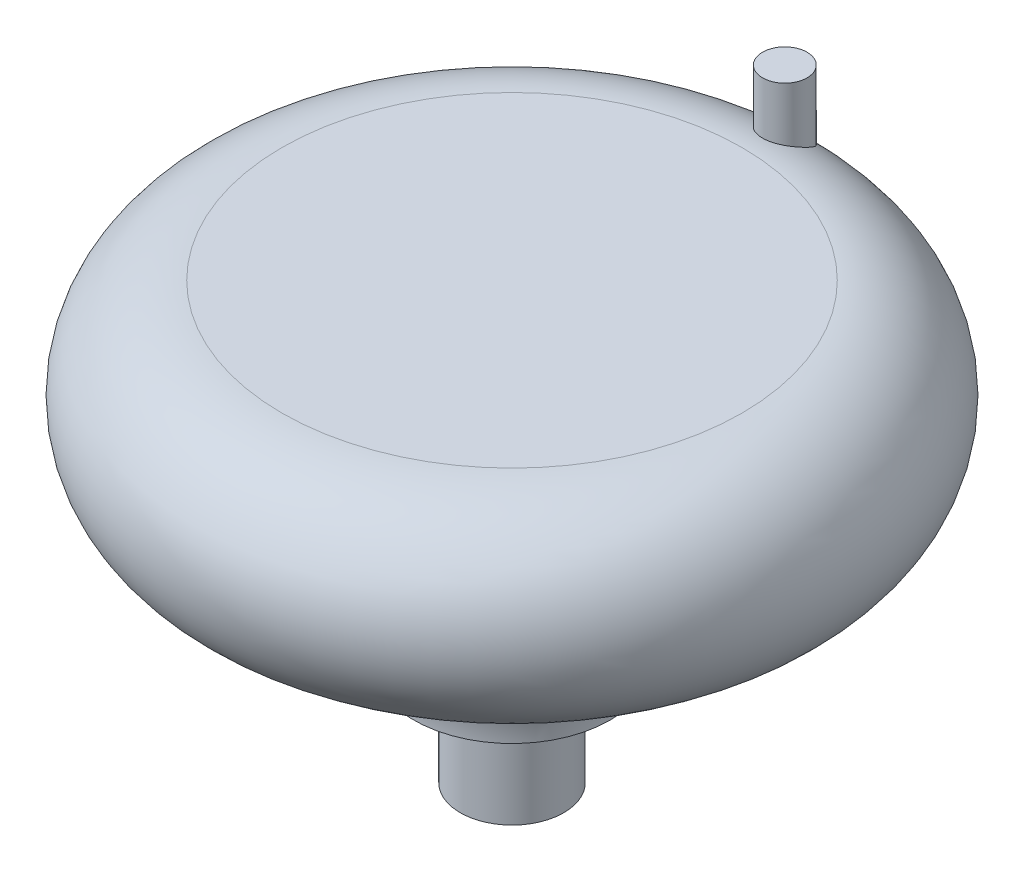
ISO-10303-21;
HEADER;
FILE_DESCRIPTION(('STEP AP214'),'2;1');
FILE_NAME('part.step','',(''),(''),'','','');
FILE_SCHEMA(('AUTOMOTIVE_DESIGN { 1 0 10303 214 1 1 1 1 }'));
ENDSEC;
DATA;
#1=APPLICATION_CONTEXT('core data for automotive mechanical design processes');
#2=APPLICATION_PROTOCOL_DEFINITION('international standard','automotive_design',2000,#1);
#3=PRODUCT_CONTEXT('',#1,'mechanical');
#4=PRODUCT('Part','Part','',(#3));
#5=PRODUCT_RELATED_PRODUCT_CATEGORY('part','',(#4));
#6=PRODUCT_DEFINITION_FORMATION('','',#4);
#7=PRODUCT_DEFINITION_CONTEXT('part definition',#1,'design');
#8=PRODUCT_DEFINITION('design','',#6,#7);
#9=PRODUCT_DEFINITION_SHAPE('','',#8);
#10=(LENGTH_UNIT() NAMED_UNIT(*) SI_UNIT(.MILLI.,.METRE.));
#11=(NAMED_UNIT(*) PLANE_ANGLE_UNIT() SI_UNIT($,.RADIAN.));
#12=(NAMED_UNIT(*) SI_UNIT($,.STERADIAN.) SOLID_ANGLE_UNIT());
#13=UNCERTAINTY_MEASURE_WITH_UNIT(LENGTH_MEASURE(1.E-05),#10,'distance_accuracy_value','');
#14=(GEOMETRIC_REPRESENTATION_CONTEXT(3) GLOBAL_UNCERTAINTY_ASSIGNED_CONTEXT((#13)) GLOBAL_UNIT_ASSIGNED_CONTEXT((#10,
#11,#12)) REPRESENTATION_CONTEXT('',''));
#15=CARTESIAN_POINT('',(0.,0.,0.));
#16=DIRECTION('',(0.,0.,1.));
#17=DIRECTION('',(1.,0.,0.));
#18=AXIS2_PLACEMENT_3D('',#15,#16,#17);
#19=CARTESIAN_POINT('',(0.,6.35,0.));
#20=DIRECTION('',(0.,-1.,0.));
#21=DIRECTION('',(1.,0.,0.));
#22=AXIS2_PLACEMENT_3D('',#19,#20,#21);
#23=PLANE('',#22);
#24=CARTESIAN_POINT('',(0.,6.35,0.));
#25=DIRECTION('',(0.,-1.,0.));
#26=DIRECTION('',(1.,0.,0.));
#27=AXIS2_PLACEMENT_3D('',#24,#25,#26);
#28=CIRCLE('',#27,4.75);
#29=CARTESIAN_POINT('',(4.75,6.35,0.));
#30=VERTEX_POINT('',#29);
#31=EDGE_CURVE('E45',#30,#30,#28,.T.);
#32=ORIENTED_EDGE('',*,*,#31,.T.);
#33=EDGE_LOOP('',(#32));
#34=FACE_BOUND('',#33,.T.);
#35=CARTESIAN_POINT('',(0.,6.35,0.));
#36=DIRECTION('',(0.,-1.,0.));
#37=DIRECTION('',(0.,0.,-1.));
#38=AXIS2_PLACEMENT_3D('',#35,#36,#37);
#39=CIRCLE('',#38,2.5);
#40=CARTESIAN_POINT('',(0.,6.35,-2.5));
#41=VERTEX_POINT('',#40);
#42=EDGE_CURVE('E55',#41,#41,#39,.T.);
#43=ORIENTED_EDGE('',*,*,#42,.F.);
#44=EDGE_LOOP('',(#43));
#45=FACE_BOUND('',#44,.T.);
#46=ADVANCED_FACE('F30',(#34,#45),#23,.T.);
#47=CARTESIAN_POINT('',(0.,17.55,0.));
#48=DIRECTION('',(0.,-1.,0.));
#49=DIRECTION('',(1.,0.,0.));
#50=AXIS2_PLACEMENT_3D('',#47,#48,#49);
#51=TOROIDAL_SURFACE('',#50,11.099803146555,4.8);
#52=CARTESIAN_POINT('',(-0.748566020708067,21.4094575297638,-13.9335820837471));
#53=CARTESIAN_POINT('',(-0.797854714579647,21.442897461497,-13.8856436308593));
#54=CARTESIAN_POINT('',(-0.841941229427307,21.4781547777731,-13.8335582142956));
#55=CARTESIAN_POINT('',(-0.919235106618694,21.5502775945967,-13.7227691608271));
#56=CARTESIAN_POINT('',(-0.952423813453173,21.5871457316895,-13.6640544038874));
#57=CARTESIAN_POINT('',(-1.00727626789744,21.6608050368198,-13.5415662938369));
#58=CARTESIAN_POINT('',(-1.02895953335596,21.6975962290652,-13.4778017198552));
#59=CARTESIAN_POINT('',(-1.06013724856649,21.769788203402,-13.346624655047));
#60=CARTESIAN_POINT('',(-1.06963728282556,21.8051896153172,-13.2792138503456));
#61=CARTESIAN_POINT('',(-1.07564050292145,21.8736722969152,-13.1419370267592));
#62=CARTESIAN_POINT('',(-1.07203999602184,21.9067329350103,-13.0720557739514));
#63=CARTESIAN_POINT('',(-1.05082320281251,21.9690822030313,-12.9327124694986));
#64=CARTESIAN_POINT('',(-1.03321534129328,21.9983730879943,-12.8632501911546));
#65=CARTESIAN_POINT('',(-0.986089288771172,22.0496734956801,-12.7342604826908));
#66=CARTESIAN_POINT('',(-0.957891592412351,22.0721136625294,-12.6744228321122));
#67=CARTESIAN_POINT('',(-0.890155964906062,22.1127840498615,-12.5599621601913));
#68=CARTESIAN_POINT('',(-0.850626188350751,22.1310172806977,-12.5053354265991));
#69=CARTESIAN_POINT('',(-0.765740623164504,22.1615775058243,-12.4088827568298));
#70=CARTESIAN_POINT('',(-0.721362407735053,22.1743127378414,-12.3663230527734));
#71=CARTESIAN_POINT('',(-0.625472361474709,22.1964498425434,-12.2891055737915));
#72=CARTESIAN_POINT('',(-0.573962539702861,22.2058526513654,-12.2544455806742));
#73=CARTESIAN_POINT('',(-0.46800637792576,22.2212093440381,-12.1958339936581));
#74=CARTESIAN_POINT('',(-0.413821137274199,22.2273075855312,-12.1714468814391));
#75=CARTESIAN_POINT('',(-0.301969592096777,22.2369766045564,-12.1319012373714));
#76=CARTESIAN_POINT('',(-0.244303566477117,22.2405475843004,-12.116741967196));
#77=CARTESIAN_POINT('',(-0.127803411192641,22.245326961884,-12.096278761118));
#78=CARTESIAN_POINT('',(-0.0689887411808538,22.2465605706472,-12.090869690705));
#79=CARTESIAN_POINT('',(0.0487372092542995,22.2468155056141,-12.0897596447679));
#80=CARTESIAN_POINT('',(0.107648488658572,22.2458368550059,-12.0940585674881));
#81=CARTESIAN_POINT('',(0.223864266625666,22.2416096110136,-12.1122199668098));
#82=CARTESIAN_POINT('',(0.281169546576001,22.2383621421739,-12.1260777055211));
#83=CARTESIAN_POINT('',(0.392574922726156,22.2294248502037,-12.1628919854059));
#84=CARTESIAN_POINT('',(0.446675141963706,22.2237351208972,-12.1858481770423));
#85=CARTESIAN_POINT('',(0.550157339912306,22.2096738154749,-12.2400852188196));
#86=CARTESIAN_POINT('',(0.599538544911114,22.2013018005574,-12.2713674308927));
#87=CARTESIAN_POINT('',(0.69222510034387,22.1816476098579,-12.3411678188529));
#88=CARTESIAN_POINT('',(0.735530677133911,22.1703655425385,-12.3796857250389));
#89=CARTESIAN_POINT('',(0.81528700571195,22.1446512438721,-12.4629309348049));
#90=CARTESIAN_POINT('',(0.851683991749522,22.130196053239,-12.5077025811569));
#91=CARTESIAN_POINT('',(0.916461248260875,22.0981862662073,-12.6017015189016));
#92=CARTESIAN_POINT('',(0.944840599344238,22.0806313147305,-12.6509293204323));
#93=CARTESIAN_POINT('',(0.994046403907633,22.0419187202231,-12.7540646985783));
#94=CARTESIAN_POINT('',(1.01457169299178,22.0206559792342,-12.8080760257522));
#95=CARTESIAN_POINT('',(1.04656816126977,21.9753445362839,-12.9175795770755));
#96=CARTESIAN_POINT('',(1.05803642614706,21.9512949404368,-12.9730722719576));
#97=CARTESIAN_POINT('',(1.07269919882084,21.8989151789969,-13.0884813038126));
#98=CARTESIAN_POINT('',(1.07517400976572,21.8703972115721,-13.1484031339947));
#99=CARTESIAN_POINT('',(1.07035173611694,21.8113995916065,-13.2668595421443));
#100=CARTESIAN_POINT('',(1.06305099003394,21.7809192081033,-13.3253935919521));
#101=CARTESIAN_POINT('',(1.03797780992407,21.7155326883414,-13.4458860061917));
#102=CARTESIAN_POINT('',(1.01919148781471,21.6804967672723,-13.5075636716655));
#103=CARTESIAN_POINT('',(0.971009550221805,21.6101265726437,-13.6265164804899));
#104=CARTESIAN_POINT('',(0.941603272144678,21.5747920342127,-13.6837871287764));
#105=CARTESIAN_POINT('',(0.870318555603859,21.5027913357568,-13.7963907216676));
#106=CARTESIAN_POINT('',(0.827722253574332,21.4662003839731,-13.8513204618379));
#107=CARTESIAN_POINT('',(0.731468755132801,21.3962844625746,-13.9529499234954));
#108=CARTESIAN_POINT('',(0.677827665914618,21.3629548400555,-13.9996614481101));
#109=CARTESIAN_POINT('',(0.57631846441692,21.3105487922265,-14.0712881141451));
#110=CARTESIAN_POINT('',(0.530907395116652,21.290071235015,-14.098666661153));
#111=CARTESIAN_POINT('',(0.435118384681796,21.2534671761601,-14.1469109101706));
#112=CARTESIAN_POINT('',(0.384744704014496,21.2373369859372,-14.1677821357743));
#113=CARTESIAN_POINT('',(0.279545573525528,21.2106262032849,-14.2020279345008));
#114=CARTESIAN_POINT('',(0.22468497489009,21.2000954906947,-14.2153351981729));
#115=CARTESIAN_POINT('',(0.112691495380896,21.1859605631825,-14.2331415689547));
#116=CARTESIAN_POINT('',(0.0555610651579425,21.1823490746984,-14.2376499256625));
#117=CARTESIAN_POINT('',(-0.0506153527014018,21.1824634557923,-14.2375048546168));
#118=CARTESIAN_POINT('',(-0.0996700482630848,21.185230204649,-14.2340490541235));
#119=CARTESIAN_POINT('',(-0.196295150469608,21.1959201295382,-14.2206025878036));
#120=CARTESIAN_POINT('',(-0.243865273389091,21.2038442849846,-14.2106106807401));
#121=CARTESIAN_POINT('',(-0.335640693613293,21.2240449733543,-14.1848599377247));
#122=CARTESIAN_POINT('',(-0.37988450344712,21.2362573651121,-14.1691859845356));
#123=CARTESIAN_POINT('',(-0.464995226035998,21.2642421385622,-14.1327617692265));
#124=CARTESIAN_POINT('',(-0.505862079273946,21.2800145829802,-14.1120114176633));
#125=CARTESIAN_POINT('',(-0.58247783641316,21.3137364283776,-14.0668935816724));
#126=CARTESIAN_POINT('',(-0.618351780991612,21.331595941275,-14.0426694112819));
#127=CARTESIAN_POINT('',(-0.686322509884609,21.369228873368,-13.9906758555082));
#128=CARTESIAN_POINT('',(-0.71841744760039,21.3890032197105,-13.9629047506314));
#129=CARTESIAN_POINT('',(-0.748566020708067,21.4094575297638,-13.9335820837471));
#130=B_SPLINE_CURVE_WITH_KNOTS('',3,(#52,#53,#54,#55,#56,#57,#58,#59,#60,#61,#62,#63,#64,#65,
#66,#67,#68,#69,#70,#71,#72,#73,#74,#75,#76,#77,#78,#79,#80,#81,#82,#83,#84,#85,#86,#87,#88,#89,
#90,#91,#92,#93,#94,#95,#96,#97,#98,#99,#100,#101,#102,#103,#104,#105,#106,#107,#108,#109,#110,
#111,#112,#113,#114,#115,#116,#117,#118,#119,#120,#121,#122,#123,#124,#125,#126,#127,#128,#129),
.UNSPECIFIED.,.T.,.F.,(4,2,2,2,2,2,2,2,2,2,2,2,2,2,2,2,2,2,2,2,2,2,2,2,2,2,2,2,2,2,2,2,2,2,2,2,
2,2,4),(0.,0.229192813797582,0.45877595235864,0.687968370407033,0.917055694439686,
1.14796020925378,1.3787259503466,1.58711463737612,1.7953537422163,1.98277387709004,
2.17014132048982,2.34848027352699,2.52680495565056,2.70319502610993,2.87958324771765,
3.0558841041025,3.23217818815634,3.40850112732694,3.58481749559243,3.76245432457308,
3.9401115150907,4.1240248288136,4.30799729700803,4.5064031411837,4.70488332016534,
4.92408965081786,5.14351668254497,5.37801352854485,5.61217078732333,5.78205330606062,
5.95179122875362,6.12301685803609,6.29406239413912,6.44108919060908,6.58814391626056,
6.73308671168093,6.87803206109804,7.01815497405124,7.15834607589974),.UNSPECIFIED.);
#131=CARTESIAN_POINT('',(-0.748566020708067,21.4094575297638,-13.9335820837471));
#132=VERTEX_POINT('',#131);
#133=EDGE_CURVE('E10',#132,#132,#130,.T.);
#134=ORIENTED_EDGE('',*,*,#133,.F.);
#135=EDGE_LOOP('',(#134));
#136=FACE_BOUND('',#135,.T.);
#137=CARTESIAN_POINT('',(0.,22.35,0.));
#138=DIRECTION('',(0.,-1.,0.));
#139=DIRECTION('',(1.,0.,0.));
#140=AXIS2_PLACEMENT_3D('',#137,#138,#139);
#141=CIRCLE('',#140,11.099803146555);
#142=CARTESIAN_POINT('',(11.099803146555,22.35,0.));
#143=VERTEX_POINT('',#142);
#144=EDGE_CURVE('E41',#143,#143,#141,.T.);
#145=ORIENTED_EDGE('',*,*,#144,.T.);
#146=EDGE_LOOP('',(#145));
#147=FACE_BOUND('',#146,.T.);
#148=CARTESIAN_POINT('',(0.,12.75,0.));
#149=DIRECTION('',(0.,-1.,0.));
#150=DIRECTION('',(1.,0.,0.));
#151=AXIS2_PLACEMENT_3D('',#148,#149,#150);
#152=CIRCLE('',#151,11.099803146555);
#153=CARTESIAN_POINT('',(11.099803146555,12.75,0.));
#154=VERTEX_POINT('',#153);
#155=EDGE_CURVE('E49',#154,#154,#152,.T.);
#156=ORIENTED_EDGE('',*,*,#155,.F.);
#157=EDGE_LOOP('',(#156));
#158=FACE_BOUND('',#157,.T.);
#159=ADVANCED_FACE('F32',(#136,#147,#158),#51,.T.);
#160=CARTESIAN_POINT('',(11.099803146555,22.35,0.));
#161=DIRECTION('',(0.,1.,0.));
#162=DIRECTION('',(-1.,0.,0.));
#163=AXIS2_PLACEMENT_3D('',#160,#161,#162);
#164=PLANE('',#163);
#165=ORIENTED_EDGE('',*,*,#144,.F.);
#166=EDGE_LOOP('',(#165));
#167=FACE_BOUND('',#166,.T.);
#168=ADVANCED_FACE('F79',(#167),#164,.T.);
#169=CARTESIAN_POINT('',(0.,6.4,0.));
#170=DIRECTION('',(0.,-1.,0.));
#171=DIRECTION('',(1.,0.,0.));
#172=AXIS2_PLACEMENT_3D('',#169,#170,#171);
#173=TOROIDAL_SURFACE('',#172,11.099803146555,6.35);
#174=ORIENTED_EDGE('',*,*,#155,.T.);
#175=EDGE_LOOP('',(#174));
#176=FACE_BOUND('',#175,.T.);
#177=ORIENTED_EDGE('',*,*,#31,.F.);
#178=EDGE_LOOP('',(#177));
#179=FACE_BOUND('',#178,.T.);
#180=ADVANCED_FACE('F83',(#176,#179),#173,.F.);
#181=CARTESIAN_POINT('',(0.,1.35,0.));
#182=DIRECTION('',(0.,1.,0.));
#183=DIRECTION('',(0.,0.,1.));
#184=AXIS2_PLACEMENT_3D('',#181,#182,#183);
#185=CYLINDRICAL_SURFACE('',#184,2.5);
#186=CARTESIAN_POINT('',(0.,1.35,0.));
#187=DIRECTION('',(0.,-1.,0.));
#188=DIRECTION('',(0.,0.,-1.));
#189=AXIS2_PLACEMENT_3D('',#186,#187,#188);
#190=CIRCLE('',#189,2.5);
#191=CARTESIAN_POINT('',(0.,1.35,-2.5));
#192=VERTEX_POINT('',#191);
#193=EDGE_CURVE('E54',#192,#192,#190,.T.);
#194=ORIENTED_EDGE('',*,*,#193,.F.);
#195=EDGE_LOOP('',(#194));
#196=FACE_BOUND('',#195,.T.);
#197=ORIENTED_EDGE('',*,*,#42,.T.);
#198=EDGE_LOOP('',(#197));
#199=FACE_BOUND('',#198,.T.);
#200=ADVANCED_FACE('F90',(#196,#199),#185,.T.);
#201=CARTESIAN_POINT('',(0.,1.35,0.));
#202=DIRECTION('',(0.,-1.,0.));
#203=DIRECTION('',(0.,0.,-1.));
#204=AXIS2_PLACEMENT_3D('',#201,#202,#203);
#205=PLANE('',#204);
#206=ORIENTED_EDGE('',*,*,#193,.T.);
#207=EDGE_LOOP('',(#206));
#208=FACE_BOUND('',#207,.T.);
#209=ADVANCED_FACE('F72',(#208),#205,.T.);
#210=CARTESIAN_POINT('',(0.,24.765,-13.163919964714));
#211=DIRECTION('',(0.,-1.,0.));
#212=DIRECTION('',(0.,0.,-1.));
#213=AXIS2_PLACEMENT_3D('',#210,#211,#212);
#214=CYLINDRICAL_SURFACE('',#213,1.07365304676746);
#215=ORIENTED_EDGE('',*,*,#133,.T.);
#216=EDGE_LOOP('',(#215));
#217=FACE_BOUND('',#216,.T.);
#218=CARTESIAN_POINT('',(0.,24.765,-13.163919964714));
#219=DIRECTION('',(0.,-1.,0.));
#220=DIRECTION('',(0.,0.,-1.));
#221=AXIS2_PLACEMENT_3D('',#218,#219,#220);
#222=CIRCLE('',#221,1.07365304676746);
#223=CARTESIAN_POINT('',(0.,24.765,-14.2375730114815));
#224=VERTEX_POINT('',#223);
#225=EDGE_CURVE('E58',#224,#224,#222,.T.);
#226=ORIENTED_EDGE('',*,*,#225,.T.);
#227=EDGE_LOOP('',(#226));
#228=FACE_BOUND('',#227,.T.);
#229=ADVANCED_FACE('F64',(#217,#228),#214,.T.);
#230=CARTESIAN_POINT('',(-0.549833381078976,24.765,-14.086098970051));
#231=DIRECTION('',(0.,1.,0.));
#232=DIRECTION('',(0.,0.,1.));
#233=AXIS2_PLACEMENT_3D('',#230,#231,#232);
#234=PLANE('',#233);
#235=ORIENTED_EDGE('',*,*,#225,.F.);
#236=EDGE_LOOP('',(#235));
#237=FACE_BOUND('',#236,.T.);
#238=ADVANCED_FACE('F66',(#237),#234,.T.);
#239=CLOSED_SHELL('',(#46,#159,#168,#180,#200,#209,#229,#238));
#240=MANIFOLD_SOLID_BREP('B2',#239);
#241=ADVANCED_BREP_SHAPE_REPRESENTATION('',(#18,#240),#14);
#242=SHAPE_DEFINITION_REPRESENTATION(#9,#241);
ENDSEC;
END-ISO-10303-21;
